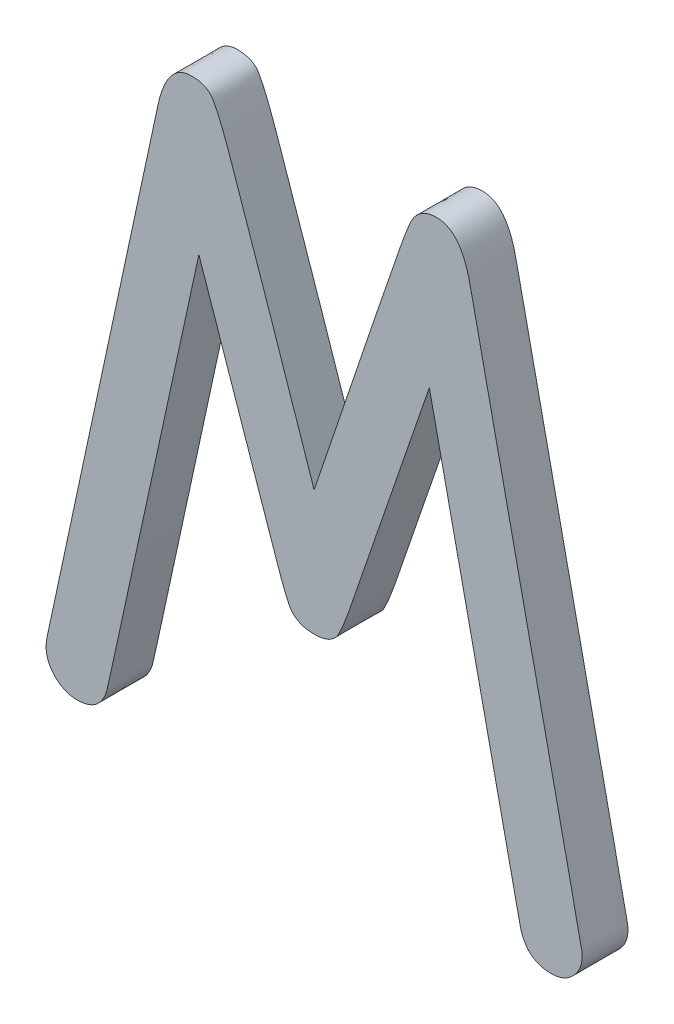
ISO-10303-21;
HEADER;
FILE_DESCRIPTION(('STEP AP214'),'2;1');
FILE_NAME('part.step','',(''),(''),'','','');
FILE_SCHEMA(('AUTOMOTIVE_DESIGN { 1 0 10303 214 1 1 1 1 }'));
ENDSEC;
DATA;
#1=APPLICATION_CONTEXT('core data for automotive mechanical design processes');
#2=APPLICATION_PROTOCOL_DEFINITION('international standard','automotive_design',2000,#1);
#3=PRODUCT_CONTEXT('',#1,'mechanical');
#4=PRODUCT('Part','Part','',(#3));
#5=PRODUCT_RELATED_PRODUCT_CATEGORY('part','',(#4));
#6=PRODUCT_DEFINITION_FORMATION('','',#4);
#7=PRODUCT_DEFINITION_CONTEXT('part definition',#1,'design');
#8=PRODUCT_DEFINITION('design','',#6,#7);
#9=PRODUCT_DEFINITION_SHAPE('','',#8);
#10=(LENGTH_UNIT() NAMED_UNIT(*) SI_UNIT(.MILLI.,.METRE.));
#11=(NAMED_UNIT(*) PLANE_ANGLE_UNIT() SI_UNIT($,.RADIAN.));
#12=(NAMED_UNIT(*) SI_UNIT($,.STERADIAN.) SOLID_ANGLE_UNIT());
#13=UNCERTAINTY_MEASURE_WITH_UNIT(LENGTH_MEASURE(1.E-05),#10,'distance_accuracy_value','');
#14=(GEOMETRIC_REPRESENTATION_CONTEXT(3) GLOBAL_UNCERTAINTY_ASSIGNED_CONTEXT((#13)) GLOBAL_UNIT_ASSIGNED_CONTEXT((#10,
#11,#12)) REPRESENTATION_CONTEXT('',''));
#15=CARTESIAN_POINT('',(0.,0.,0.));
#16=DIRECTION('',(0.,0.,1.));
#17=DIRECTION('',(1.,0.,0.));
#18=AXIS2_PLACEMENT_3D('',#15,#16,#17);
#19=CARTESIAN_POINT('',(-37.4023139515,0.663996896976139,0.500000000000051));
#20=CARTESIAN_POINT('',(-36.9523139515,2.00447308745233,0.500000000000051));
#21=CARTESIAN_POINT('',(-36.4925044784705,3.34157594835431,0.500000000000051));
#22=CARTESIAN_POINT('',(-36.3832663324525,3.65923499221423,0.500000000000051));
#23=CARTESIAN_POINT('',(-36.3398412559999,3.73988156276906,0.500000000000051));
#24=CARTESIAN_POINT('',(-36.2499329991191,3.90685403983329,0.500000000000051));
#25=CARTESIAN_POINT('',(-36.0642187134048,3.90685403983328,0.500000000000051));
#26=CARTESIAN_POINT('',(-35.7975520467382,3.90685403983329,0.500000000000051));
#27=CARTESIAN_POINT('',(-35.6995990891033,3.45029364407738,0.500000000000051));
#28=CARTESIAN_POINT('',(-35.0951710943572,0.633044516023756,0.500000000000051));
#29=CARTESIAN_POINT('',(-34.4896864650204,-2.18397856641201,0.500000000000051));
#30=CARTESIAN_POINT('',(-34.4785044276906,-2.23600310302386,0.500000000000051));
#31=CARTESIAN_POINT('',(-34.4785044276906,-2.278860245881,0.500000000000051));
#32=CARTESIAN_POINT('',(-34.4785044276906,-2.42647929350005,0.500000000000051));
#33=CARTESIAN_POINT('',(-34.5971759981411,-2.5316654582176,0.500000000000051));
#34=CARTESIAN_POINT('',(-34.6880282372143,-2.61219357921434,0.500000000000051));
#35=CARTESIAN_POINT('',(-34.8165996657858,-2.61219357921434,0.500000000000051));
#36=CARTESIAN_POINT('',(-35.0927901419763,-2.61219357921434,0.500000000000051));
#37=CARTESIAN_POINT('',(-35.1554588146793,-2.32188229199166,0.500000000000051));
#38=CARTESIAN_POINT('',(-35.6499329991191,-0.0312411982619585,0.500000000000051));
#39=CARTESIAN_POINT('',(-36.1451710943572,2.25923499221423,0.500000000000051));
#40=B_SPLINE_CURVE_WITH_KNOTS('',2,(#19,#20,#21,#22,#23,#24,#25,#26,#27,#28,#29,#30,#31,#32,#33,
#34,#35,#36,#37,#38,#39),.UNSPECIFIED.,.F.,.F.,(3,2,2,2,2,2,2,2,2,2,3),(0.,1.,2.,3.,4.,5.,6.,7.,
8.,9.,10.),.UNSPECIFIED.);
#41=DIRECTION('',(0.,0.,-1.));
#42=VECTOR('',#41,1.);
#43=SURFACE_OF_LINEAR_EXTRUSION('',#40,#42);
#44=CARTESIAN_POINT('',(-37.4023139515,0.663996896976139,0.));
#45=CARTESIAN_POINT('',(-36.9523139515,2.00447308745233,0.));
#46=CARTESIAN_POINT('',(-36.4925044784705,3.34157594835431,0.));
#47=CARTESIAN_POINT('',(-36.3832663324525,3.65923499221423,0.));
#48=CARTESIAN_POINT('',(-36.3398412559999,3.73988156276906,0.));
#49=CARTESIAN_POINT('',(-36.2499329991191,3.90685403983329,0.));
#50=CARTESIAN_POINT('',(-36.0642187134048,3.90685403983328,0.));
#51=CARTESIAN_POINT('',(-35.7975520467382,3.90685403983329,0.));
#52=CARTESIAN_POINT('',(-35.6995990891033,3.45029364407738,0.));
#53=CARTESIAN_POINT('',(-35.0951710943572,0.633044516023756,0.));
#54=CARTESIAN_POINT('',(-34.4896864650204,-2.18397856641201,0.));
#55=CARTESIAN_POINT('',(-34.4785044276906,-2.23600310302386,0.));
#56=CARTESIAN_POINT('',(-34.4785044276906,-2.278860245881,0.));
#57=CARTESIAN_POINT('',(-34.4785044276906,-2.42647929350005,0.));
#58=CARTESIAN_POINT('',(-34.5971759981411,-2.5316654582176,0.));
#59=CARTESIAN_POINT('',(-34.6880282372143,-2.61219357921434,0.));
#60=CARTESIAN_POINT('',(-34.8165996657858,-2.61219357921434,0.));
#61=CARTESIAN_POINT('',(-35.0927901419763,-2.61219357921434,0.));
#62=CARTESIAN_POINT('',(-35.1554588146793,-2.32188229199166,0.));
#63=CARTESIAN_POINT('',(-35.6499329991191,-0.0312411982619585,0.));
#64=CARTESIAN_POINT('',(-36.1451710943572,2.25923499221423,0.));
#65=B_SPLINE_CURVE_WITH_KNOTS('',2,(#44,#45,#46,#47,#48,#49,#50,#51,#52,#53,#54,#55,#56,#57,#58,
#59,#60,#61,#62,#63,#64),.UNSPECIFIED.,.F.,.F.,(3,2,2,2,2,2,2,2,2,2,3),(0.,1.,2.,3.,4.,5.,6.,7.,
8.,9.,10.),.UNSPECIFIED.);
#66=CARTESIAN_POINT('',(-37.4023139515,0.663996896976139,0.));
#67=VERTEX_POINT('',#66);
#68=CARTESIAN_POINT('',(-36.1451710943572,2.25923499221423,0.));
#69=VERTEX_POINT('',#68);
#70=EDGE_CURVE('E50',#67,#69,#65,.T.);
#71=ORIENTED_EDGE('',*,*,#70,.F.);
#72=DIRECTION('',(0.,0.,-1.));
#73=VECTOR('',#72,1.);
#74=CARTESIAN_POINT('',(-37.4023139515,0.663996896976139,0.500000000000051));
#75=LINE('',#74,#73);
#76=CARTESIAN_POINT('',(-37.4023139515,0.663996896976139,0.500000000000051));
#77=VERTEX_POINT('',#76);
#78=EDGE_CURVE('E32',#77,#67,#75,.T.);
#79=ORIENTED_EDGE('',*,*,#78,.F.);
#80=CARTESIAN_POINT('',(-36.1451710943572,2.25923499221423,0.500000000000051));
#81=VERTEX_POINT('',#80);
#82=EDGE_CURVE('E52',#77,#81,#40,.T.);
#83=ORIENTED_EDGE('',*,*,#82,.T.);
#84=DIRECTION('',(0.,0.,-1.));
#85=VECTOR('',#84,1.);
#86=CARTESIAN_POINT('',(-36.1451710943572,2.25923499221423,0.500000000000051));
#87=LINE('',#86,#85);
#88=EDGE_CURVE('E11',#81,#69,#87,.T.);
#89=ORIENTED_EDGE('',*,*,#88,.T.);
#90=EDGE_LOOP('',(#71,#79,#83,#89));
#91=FACE_BOUND('',#90,.T.);
#92=ADVANCED_FACE('F16',(#91),#43,.T.);
#93=CARTESIAN_POINT('',(-36.1451710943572,2.25923499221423,0.500000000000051));
#94=CARTESIAN_POINT('',(-36.5594568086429,1.05209213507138,0.500000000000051));
#95=CARTESIAN_POINT('',(-36.9744939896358,-0.154792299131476,0.500000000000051));
#96=CARTESIAN_POINT('',(-37.1023139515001,-0.526479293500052,0.500000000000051));
#97=CARTESIAN_POINT('',(-37.1531710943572,-0.594288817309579,0.500000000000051));
#98=CARTESIAN_POINT('',(-37.2308853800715,-0.69790786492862,0.500000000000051));
#99=CARTESIAN_POINT('',(-37.4023139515,-0.697907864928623,0.500000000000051));
#100=CARTESIAN_POINT('',(-37.5785044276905,-0.697907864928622,0.500000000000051));
#101=CARTESIAN_POINT('',(-37.654347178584,-0.592894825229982,0.500000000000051));
#102=CARTESIAN_POINT('',(-37.7023139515,-0.526479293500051,0.500000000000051));
#103=CARTESIAN_POINT('',(-37.8301339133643,-0.154792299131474,0.500000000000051));
#104=CARTESIAN_POINT('',(-38.2451710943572,1.05209213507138,0.500000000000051));
#105=CARTESIAN_POINT('',(-38.6594568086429,2.25923499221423,0.500000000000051));
#106=B_SPLINE_CURVE_WITH_KNOTS('',2,(#93,#94,#95,#96,#97,#98,#99,#100,#101,#102,#103,#104,#105),
.UNSPECIFIED.,.F.,.F.,(3,2,2,2,2,2,3),(10.,11.,12.,13.,14.,15.,16.),.UNSPECIFIED.);
#107=DIRECTION('',(0.,0.,-1.));
#108=VECTOR('',#107,1.);
#109=SURFACE_OF_LINEAR_EXTRUSION('',#106,#108);
#110=CARTESIAN_POINT('',(-36.1451710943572,2.25923499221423,0.));
#111=CARTESIAN_POINT('',(-36.5594568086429,1.05209213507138,0.));
#112=CARTESIAN_POINT('',(-36.9744939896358,-0.154792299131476,0.));
#113=CARTESIAN_POINT('',(-37.1023139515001,-0.526479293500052,0.));
#114=CARTESIAN_POINT('',(-37.1531710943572,-0.594288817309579,0.));
#115=CARTESIAN_POINT('',(-37.2308853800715,-0.69790786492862,0.));
#116=CARTESIAN_POINT('',(-37.4023139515,-0.697907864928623,0.));
#117=CARTESIAN_POINT('',(-37.5785044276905,-0.697907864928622,0.));
#118=CARTESIAN_POINT('',(-37.654347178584,-0.592894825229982,0.));
#119=CARTESIAN_POINT('',(-37.7023139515,-0.526479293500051,0.));
#120=CARTESIAN_POINT('',(-37.8301339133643,-0.154792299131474,0.));
#121=CARTESIAN_POINT('',(-38.2451710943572,1.05209213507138,0.));
#122=CARTESIAN_POINT('',(-38.6594568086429,2.25923499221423,0.));
#123=B_SPLINE_CURVE_WITH_KNOTS('',2,(#110,#111,#112,#113,#114,#115,#116,#117,#118,#119,#120,
#121,#122),.UNSPECIFIED.,.F.,.F.,(3,2,2,2,2,2,3),(10.,11.,12.,13.,14.,15.,16.),.UNSPECIFIED.);
#124=CARTESIAN_POINT('',(-38.6594568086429,2.25923499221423,0.));
#125=VERTEX_POINT('',#124);
#126=EDGE_CURVE('E56',#69,#125,#123,.T.);
#127=ORIENTED_EDGE('',*,*,#126,.F.);
#128=ORIENTED_EDGE('',*,*,#88,.F.);
#129=CARTESIAN_POINT('',(-38.6594568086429,2.25923499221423,0.500000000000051));
#130=VERTEX_POINT('',#129);
#131=EDGE_CURVE('E96',#81,#130,#106,.T.);
#132=ORIENTED_EDGE('',*,*,#131,.T.);
#133=DIRECTION('',(0.,0.,-1.));
#134=VECTOR('',#133,1.);
#135=CARTESIAN_POINT('',(-38.6594568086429,2.25923499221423,0.500000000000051));
#136=LINE('',#135,#134);
#137=EDGE_CURVE('E25',#130,#125,#136,.T.);
#138=ORIENTED_EDGE('',*,*,#137,.T.);
#139=EDGE_LOOP('',(#127,#128,#132,#138));
#140=FACE_BOUND('',#139,.T.);
#141=ADVANCED_FACE('F57',(#140),#109,.T.);
#142=CARTESIAN_POINT('',(-38.6594568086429,2.25923499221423,0.500000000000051));
#143=CARTESIAN_POINT('',(-39.154694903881,-0.031241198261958,0.50000000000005));
#144=CARTESIAN_POINT('',(-39.6532044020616,-2.3210051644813,0.50000000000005));
#145=CARTESIAN_POINT('',(-39.7165996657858,-2.61219357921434,0.50000000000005));
#146=CARTESIAN_POINT('',(-39.9880282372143,-2.61219357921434,0.50000000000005));
#147=CARTESIAN_POINT('',(-40.1165996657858,-2.61219357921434,0.50000000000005));
#148=CARTESIAN_POINT('',(-40.207451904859,-2.5316654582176,0.50000000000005));
#149=CARTESIAN_POINT('',(-40.3261234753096,-2.42647929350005,0.50000000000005));
#150=CARTESIAN_POINT('',(-40.3261234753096,-2.2740983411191,0.50000000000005));
#151=CARTESIAN_POINT('',(-40.3261234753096,-2.23124119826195,0.50000000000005));
#152=CARTESIAN_POINT('',(-40.3159411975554,-2.18376336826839,0.50000000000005));
#153=CARTESIAN_POINT('',(-39.7118377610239,0.633044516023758,0.50000000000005));
#154=CARTESIAN_POINT('',(-39.1055566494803,3.44938413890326,0.50000000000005));
#155=CARTESIAN_POINT('',(-39.0070758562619,3.90685403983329,0.50000000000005));
#156=CARTESIAN_POINT('',(-38.7404091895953,3.90685403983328,0.50000000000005));
#157=CARTESIAN_POINT('',(-38.6023139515,3.90685403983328,0.50000000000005));
#158=CARTESIAN_POINT('',(-38.5356472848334,3.84018737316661,0.50000000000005));
#159=CARTESIAN_POINT('',(-38.4642187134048,3.76875880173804,0.50000000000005));
#160=CARTESIAN_POINT('',(-38.315627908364,3.34033161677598,0.500000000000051));
#161=CARTESIAN_POINT('',(-37.8523139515,2.00447308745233,0.500000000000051));
#162=CARTESIAN_POINT('',(-37.4023139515,0.663996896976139,0.500000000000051));
#163=B_SPLINE_CURVE_WITH_KNOTS('',2,(#142,#143,#144,#145,#146,#147,#148,#149,#150,#151,#152,
#153,#154,#155,#156,#157,#158,#159,#160,#161,#162),.UNSPECIFIED.,.F.,.F.,(3,2,2,2,2,2,2,2,2,2,
3),(16.,17.,18.,19.,20.,21.,22.,23.,24.,25.,26.),.UNSPECIFIED.);
#164=DIRECTION('',(0.,0.,-1.));
#165=VECTOR('',#164,1.);
#166=SURFACE_OF_LINEAR_EXTRUSION('',#163,#165);
#167=CARTESIAN_POINT('',(-38.6594568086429,2.25923499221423,0.));
#168=CARTESIAN_POINT('',(-39.154694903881,-0.031241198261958,0.));
#169=CARTESIAN_POINT('',(-39.6532044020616,-2.3210051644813,0.));
#170=CARTESIAN_POINT('',(-39.7165996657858,-2.61219357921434,0.));
#171=CARTESIAN_POINT('',(-39.9880282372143,-2.61219357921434,0.));
#172=CARTESIAN_POINT('',(-40.1165996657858,-2.61219357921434,0.));
#173=CARTESIAN_POINT('',(-40.207451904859,-2.5316654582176,0.));
#174=CARTESIAN_POINT('',(-40.3261234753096,-2.42647929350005,0.));
#175=CARTESIAN_POINT('',(-40.3261234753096,-2.2740983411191,0.));
#176=CARTESIAN_POINT('',(-40.3261234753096,-2.23124119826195,0.));
#177=CARTESIAN_POINT('',(-40.3159411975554,-2.18376336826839,0.));
#178=CARTESIAN_POINT('',(-39.7118377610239,0.633044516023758,0.));
#179=CARTESIAN_POINT('',(-39.1055566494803,3.44938413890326,0.));
#180=CARTESIAN_POINT('',(-39.0070758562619,3.90685403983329,0.));
#181=CARTESIAN_POINT('',(-38.7404091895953,3.90685403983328,0.));
#182=CARTESIAN_POINT('',(-38.6023139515,3.90685403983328,0.));
#183=CARTESIAN_POINT('',(-38.5356472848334,3.84018737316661,0.));
#184=CARTESIAN_POINT('',(-38.4642187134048,3.76875880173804,0.));
#185=CARTESIAN_POINT('',(-38.315627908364,3.34033161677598,0.));
#186=CARTESIAN_POINT('',(-37.8523139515,2.00447308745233,0.));
#187=CARTESIAN_POINT('',(-37.4023139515,0.663996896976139,0.));
#188=B_SPLINE_CURVE_WITH_KNOTS('',2,(#167,#168,#169,#170,#171,#172,#173,#174,#175,#176,#177,
#178,#179,#180,#181,#182,#183,#184,#185,#186,#187),.UNSPECIFIED.,.F.,.F.,(3,2,2,2,2,2,2,2,2,2,
3),(16.,17.,18.,19.,20.,21.,22.,23.,24.,25.,26.),.UNSPECIFIED.);
#189=EDGE_CURVE('E61',#125,#67,#188,.T.);
#190=ORIENTED_EDGE('',*,*,#189,.F.);
#191=ORIENTED_EDGE('',*,*,#137,.F.);
#192=EDGE_CURVE('E105',#130,#77,#163,.T.);
#193=ORIENTED_EDGE('',*,*,#192,.T.);
#194=ORIENTED_EDGE('',*,*,#78,.T.);
#195=EDGE_LOOP('',(#190,#191,#193,#194));
#196=FACE_BOUND('',#195,.T.);
#197=ADVANCED_FACE('F115',(#196),#166,.T.);
#198=CARTESIAN_POINT('',(-34.4896864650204,-2.18397856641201,0.500000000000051));
#199=DIRECTION('',(0.,0.,1.));
#200=DIRECTION('',(-0.318247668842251,-0.948007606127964,0.));
#201=AXIS2_PLACEMENT_3D('',#198,#199,#200);
#202=PLANE('',#201);
#203=ORIENTED_EDGE('',*,*,#82,.F.);
#204=ORIENTED_EDGE('',*,*,#192,.F.);
#205=ORIENTED_EDGE('',*,*,#131,.F.);
#206=EDGE_LOOP('',(#203,#204,#205));
#207=FACE_BOUND('',#206,.T.);
#208=ADVANCED_FACE('F118',(#207),#202,.T.);
#209=CARTESIAN_POINT('',(-34.4896864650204,-2.18397856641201,0.));
#210=DIRECTION('',(0.,0.,1.));
#211=DIRECTION('',(-0.318247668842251,-0.948007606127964,0.));
#212=AXIS2_PLACEMENT_3D('',#209,#210,#211);
#213=PLANE('',#212);
#214=ORIENTED_EDGE('',*,*,#70,.T.);
#215=ORIENTED_EDGE('',*,*,#126,.T.);
#216=ORIENTED_EDGE('',*,*,#189,.T.);
#217=EDGE_LOOP('',(#214,#215,#216));
#218=FACE_BOUND('',#217,.T.);
#219=ADVANCED_FACE('F63',(#218),#213,.F.);
#220=CLOSED_SHELL('',(#92,#141,#197,#208,#219));
#221=MANIFOLD_SOLID_BREP('B1',#220);
#222=ADVANCED_BREP_SHAPE_REPRESENTATION('',(#18,#221),#14);
#223=SHAPE_DEFINITION_REPRESENTATION(#9,#222);
ENDSEC;
END-ISO-10303-21;
